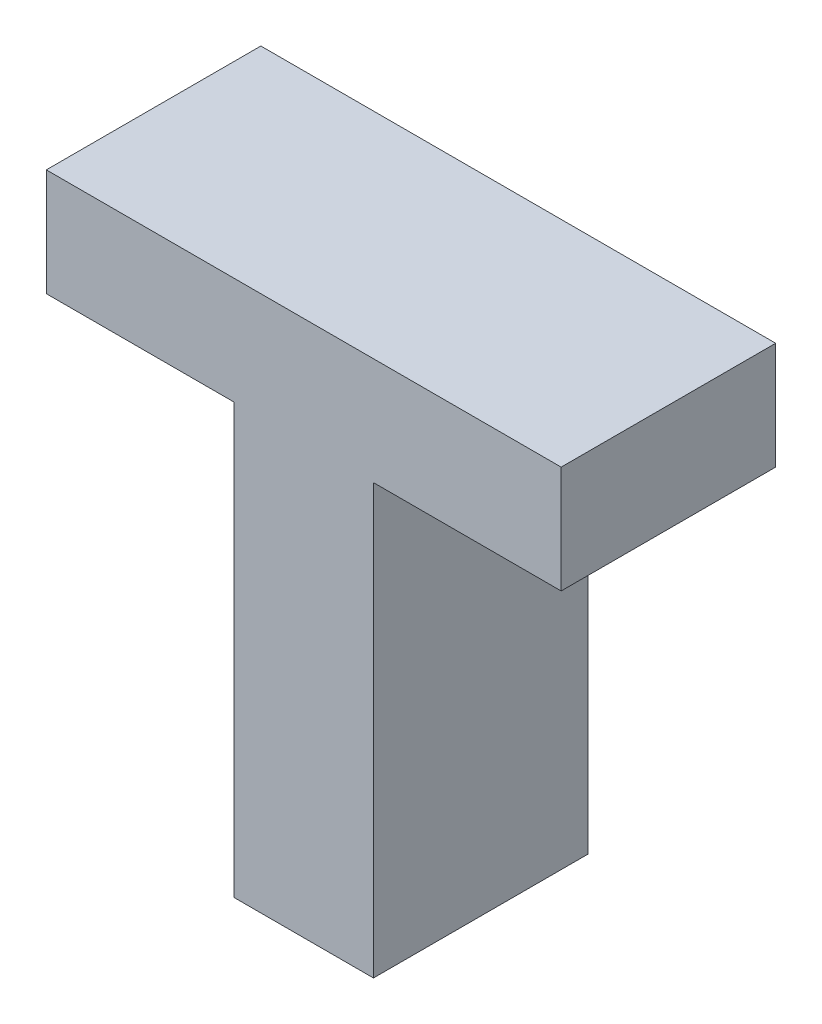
from build123d import *

# Parameters (mm, degrees)
EXTRUDE1_DEPTH = 40


with BuildPart() as part:
    # Sketch2 → Extrude1 (new body)
    with BuildSketch(Plane.XY):
        Polygon((26, 80), (61, 80), (61, 100), (-35, 100), (-35, 80), (0, 80), (0, 0), (26, 0), align=None)
    extrude(amount=EXTRUDE1_DEPTH)


solid = part.part
